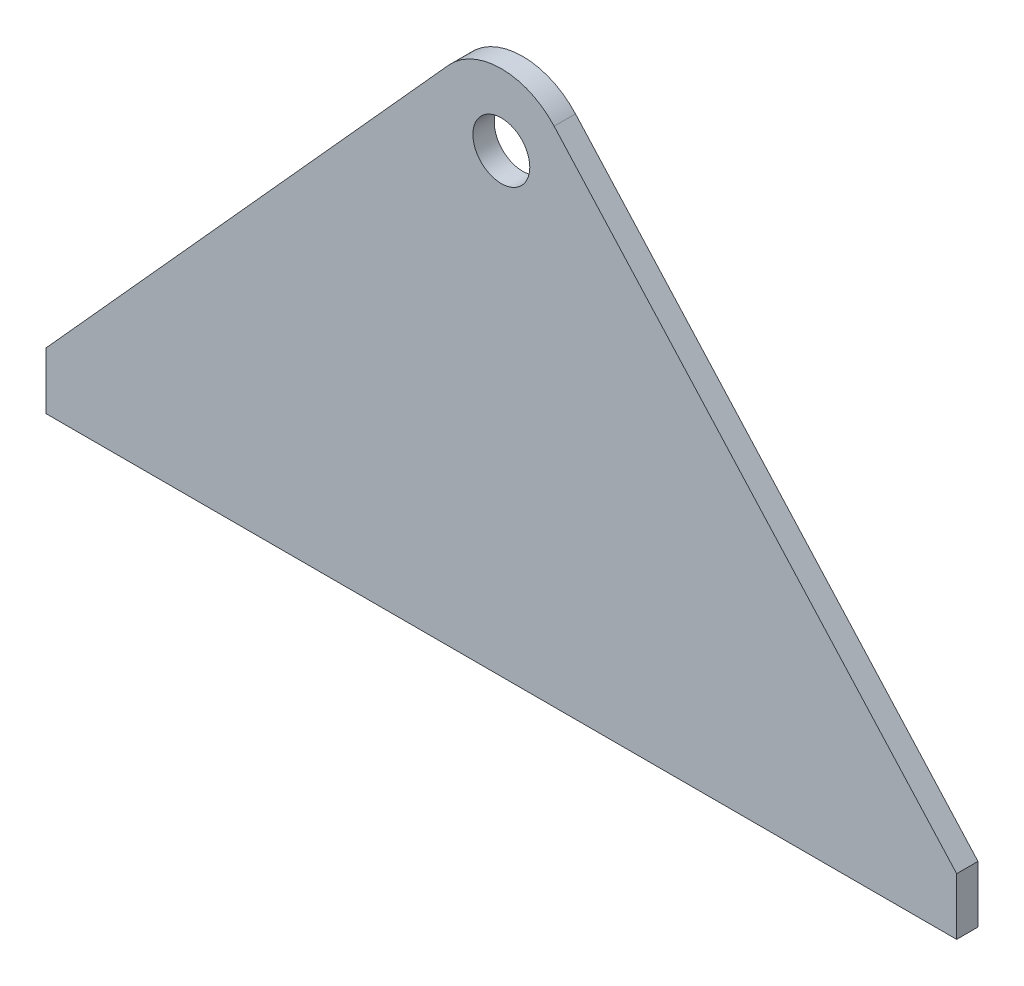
from build123d import *

# Parameters (mm, degrees)
SKETCH1_R      = 12.7
EXTRUDE1_DEPTH = 9.525


with BuildPart() as part:
    # Sketch1 → Extrude1 (new body)
    with BuildSketch(Plane.XY):
        with BuildLine():
            Line((-203.2, -203.2), (203.2, -203.2))
            Line((203.2, -203.2), (203.2, -177.8))
            Line((203.2, -177.8), (23.572203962, 21.270018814))
            ThreePointArc((23.572203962, 21.270018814), (0, 31.75), (-23.572203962, 21.270018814))
            Line((-23.572203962, 21.270018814), (-203.2, -177.8))
            Line((-203.2, -177.8), (-203.2, -203.2))
        make_face()
        Circle(SKETCH1_R, mode=Mode.SUBTRACT)
    extrude(amount=-EXTRUDE1_DEPTH)


solid = part.part
